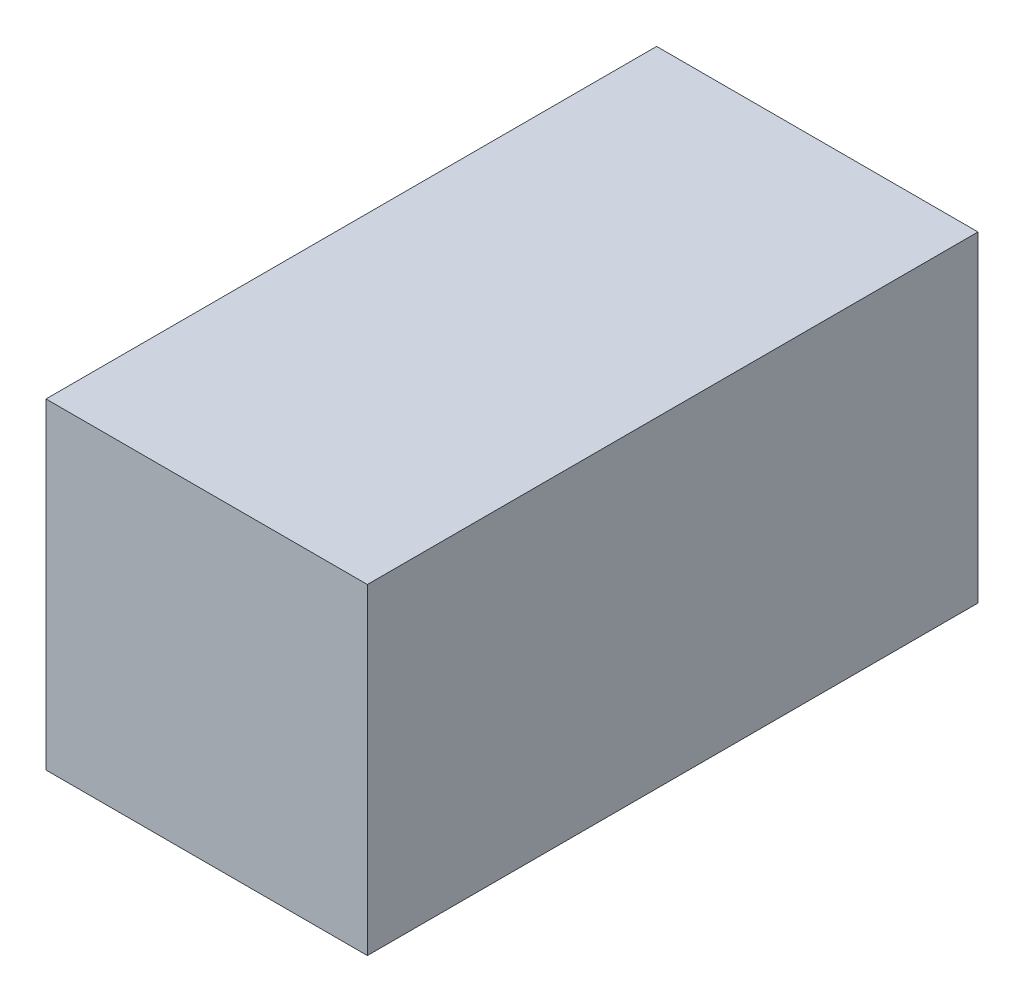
ISO-10303-21;
HEADER;
FILE_DESCRIPTION(('STEP AP214'),'2;1');
FILE_NAME('part.step','',(''),(''),'','','');
FILE_SCHEMA(('AUTOMOTIVE_DESIGN { 1 0 10303 214 1 1 1 1 }'));
ENDSEC;
DATA;
#1=APPLICATION_CONTEXT('core data for automotive mechanical design processes');
#2=APPLICATION_PROTOCOL_DEFINITION('international standard','automotive_design',2000,#1);
#3=PRODUCT_CONTEXT('',#1,'mechanical');
#4=PRODUCT('Part','Part','',(#3));
#5=PRODUCT_RELATED_PRODUCT_CATEGORY('part','',(#4));
#6=PRODUCT_DEFINITION_FORMATION('','',#4);
#7=PRODUCT_DEFINITION_CONTEXT('part definition',#1,'design');
#8=PRODUCT_DEFINITION('design','',#6,#7);
#9=PRODUCT_DEFINITION_SHAPE('','',#8);
#10=(LENGTH_UNIT() NAMED_UNIT(*) SI_UNIT(.MILLI.,.METRE.));
#11=(NAMED_UNIT(*) PLANE_ANGLE_UNIT() SI_UNIT($,.RADIAN.));
#12=(NAMED_UNIT(*) SI_UNIT($,.STERADIAN.) SOLID_ANGLE_UNIT());
#13=UNCERTAINTY_MEASURE_WITH_UNIT(LENGTH_MEASURE(1.E-05),#10,'distance_accuracy_value','');
#14=(GEOMETRIC_REPRESENTATION_CONTEXT(3) GLOBAL_UNCERTAINTY_ASSIGNED_CONTEXT((#13)) GLOBAL_UNIT_ASSIGNED_CONTEXT((#10,
#11,#12)) REPRESENTATION_CONTEXT('',''));
#15=CARTESIAN_POINT('',(0.,0.,0.));
#16=DIRECTION('',(0.,0.,1.));
#17=DIRECTION('',(1.,0.,0.));
#18=AXIS2_PLACEMENT_3D('',#15,#16,#17);
#19=CARTESIAN_POINT('',(50.,0.,95.));
#20=DIRECTION('',(0.,1.,0.));
#21=DIRECTION('',(-1.,0.,0.));
#22=AXIS2_PLACEMENT_3D('',#19,#20,#21);
#23=PLANE('',#22);
#24=DIRECTION('',(1.,0.,0.));
#25=VECTOR('',#24,1.);
#26=CARTESIAN_POINT('',(50.,0.,0.));
#27=LINE('',#26,#25);
#28=CARTESIAN_POINT('',(0.,0.,0.));
#29=VERTEX_POINT('',#28);
#30=CARTESIAN_POINT('',(50.,0.,0.));
#31=VERTEX_POINT('',#30);
#32=EDGE_CURVE('E106',#29,#31,#27,.T.);
#33=ORIENTED_EDGE('',*,*,#32,.T.);
#34=DIRECTION('',(0.,0.,-1.));
#35=VECTOR('',#34,1.);
#36=CARTESIAN_POINT('',(50.,0.,95.));
#37=LINE('',#36,#35);
#38=CARTESIAN_POINT('',(50.,0.,95.));
#39=VERTEX_POINT('',#38);
#40=EDGE_CURVE('E11',#39,#31,#37,.T.);
#41=ORIENTED_EDGE('',*,*,#40,.F.);
#42=DIRECTION('',(1.,0.,0.));
#43=VECTOR('',#42,1.);
#44=CARTESIAN_POINT('',(50.,0.,95.));
#45=LINE('',#44,#43);
#46=CARTESIAN_POINT('',(0.,0.,95.));
#47=VERTEX_POINT('',#46);
#48=EDGE_CURVE('E94',#47,#39,#45,.T.);
#49=ORIENTED_EDGE('',*,*,#48,.F.);
#50=DIRECTION('',(0.,0.,-1.));
#51=VECTOR('',#50,1.);
#52=CARTESIAN_POINT('',(0.,0.,95.));
#53=LINE('',#52,#51);
#54=EDGE_CURVE('E102',#47,#29,#53,.T.);
#55=ORIENTED_EDGE('',*,*,#54,.T.);
#56=EDGE_LOOP('',(#33,#41,#49,#55));
#57=FACE_BOUND('',#56,.T.);
#58=ADVANCED_FACE('F43',(#57),#23,.F.);
#59=CARTESIAN_POINT('',(50.,50.,95.));
#60=DIRECTION('',(-1.,0.,0.));
#61=DIRECTION('',(0.,-1.,0.));
#62=AXIS2_PLACEMENT_3D('',#59,#60,#61);
#63=PLANE('',#62);
#64=DIRECTION('',(0.,1.,0.));
#65=VECTOR('',#64,1.);
#66=CARTESIAN_POINT('',(50.,50.,0.));
#67=LINE('',#66,#65);
#68=CARTESIAN_POINT('',(50.,50.,0.));
#69=VERTEX_POINT('',#68);
#70=EDGE_CURVE('E98',#31,#69,#67,.T.);
#71=ORIENTED_EDGE('',*,*,#70,.T.);
#72=DIRECTION('',(0.,0.,-1.));
#73=VECTOR('',#72,1.);
#74=CARTESIAN_POINT('',(50.,50.,95.));
#75=LINE('',#74,#73);
#76=CARTESIAN_POINT('',(50.,50.,95.));
#77=VERTEX_POINT('',#76);
#78=EDGE_CURVE('E51',#77,#69,#75,.T.);
#79=ORIENTED_EDGE('',*,*,#78,.F.);
#80=DIRECTION('',(0.,1.,0.));
#81=VECTOR('',#80,1.);
#82=CARTESIAN_POINT('',(50.,50.,95.));
#83=LINE('',#82,#81);
#84=EDGE_CURVE('E89',#39,#77,#83,.T.);
#85=ORIENTED_EDGE('',*,*,#84,.F.);
#86=ORIENTED_EDGE('',*,*,#40,.T.);
#87=EDGE_LOOP('',(#71,#79,#85,#86));
#88=FACE_BOUND('',#87,.T.);
#89=ADVANCED_FACE('F97',(#88),#63,.F.);
#90=CARTESIAN_POINT('',(0.,50.,95.));
#91=DIRECTION('',(0.,-1.,0.));
#92=DIRECTION('',(1.,0.,0.));
#93=AXIS2_PLACEMENT_3D('',#90,#91,#92);
#94=PLANE('',#93);
#95=DIRECTION('',(-1.,0.,0.));
#96=VECTOR('',#95,1.);
#97=CARTESIAN_POINT('',(0.,50.,0.));
#98=LINE('',#97,#96);
#99=CARTESIAN_POINT('',(0.,50.,0.));
#100=VERTEX_POINT('',#99);
#101=EDGE_CURVE('E76',#69,#100,#98,.T.);
#102=ORIENTED_EDGE('',*,*,#101,.T.);
#103=DIRECTION('',(0.,0.,-1.));
#104=VECTOR('',#103,1.);
#105=CARTESIAN_POINT('',(0.,50.,95.));
#106=LINE('',#105,#104);
#107=CARTESIAN_POINT('',(0.,50.,95.));
#108=VERTEX_POINT('',#107);
#109=EDGE_CURVE('E99',#108,#100,#106,.T.);
#110=ORIENTED_EDGE('',*,*,#109,.F.);
#111=DIRECTION('',(-1.,0.,0.));
#112=VECTOR('',#111,1.);
#113=CARTESIAN_POINT('',(0.,50.,95.));
#114=LINE('',#113,#112);
#115=EDGE_CURVE('E92',#77,#108,#114,.T.);
#116=ORIENTED_EDGE('',*,*,#115,.F.);
#117=ORIENTED_EDGE('',*,*,#78,.T.);
#118=EDGE_LOOP('',(#102,#110,#116,#117));
#119=FACE_BOUND('',#118,.T.);
#120=ADVANCED_FACE('F100',(#119),#94,.F.);
#121=CARTESIAN_POINT('',(0.,0.,95.));
#122=DIRECTION('',(1.,0.,0.));
#123=DIRECTION('',(0.,0.,-1.));
#124=AXIS2_PLACEMENT_3D('',#121,#122,#123);
#125=PLANE('',#124);
#126=DIRECTION('',(0.,-1.,0.));
#127=VECTOR('',#126,1.);
#128=CARTESIAN_POINT('',(0.,0.,0.));
#129=LINE('',#128,#127);
#130=EDGE_CURVE('E82',#100,#29,#129,.T.);
#131=ORIENTED_EDGE('',*,*,#130,.T.);
#132=ORIENTED_EDGE('',*,*,#54,.F.);
#133=DIRECTION('',(0.,-1.,0.));
#134=VECTOR('',#133,1.);
#135=CARTESIAN_POINT('',(0.,0.,95.));
#136=LINE('',#135,#134);
#137=EDGE_CURVE('E59',#108,#47,#136,.T.);
#138=ORIENTED_EDGE('',*,*,#137,.F.);
#139=ORIENTED_EDGE('',*,*,#109,.T.);
#140=EDGE_LOOP('',(#131,#132,#138,#139));
#141=FACE_BOUND('',#140,.T.);
#142=ADVANCED_FACE('F113',(#141),#125,.F.);
#143=CARTESIAN_POINT('',(0.,0.,95.));
#144=DIRECTION('',(0.,0.,-1.));
#145=DIRECTION('',(-1.,0.,0.));
#146=AXIS2_PLACEMENT_3D('',#143,#144,#145);
#147=PLANE('',#146);
#148=ORIENTED_EDGE('',*,*,#48,.T.);
#149=ORIENTED_EDGE('',*,*,#84,.T.);
#150=ORIENTED_EDGE('',*,*,#115,.T.);
#151=ORIENTED_EDGE('',*,*,#137,.T.);
#152=EDGE_LOOP('',(#148,#149,#150,#151));
#153=FACE_BOUND('',#152,.T.);
#154=ADVANCED_FACE('F90',(#153),#147,.F.);
#155=CARTESIAN_POINT('',(0.,0.,0.));
#156=DIRECTION('',(0.,0.,-1.));
#157=DIRECTION('',(-1.,0.,0.));
#158=AXIS2_PLACEMENT_3D('',#155,#156,#157);
#159=PLANE('',#158);
#160=ORIENTED_EDGE('',*,*,#32,.F.);
#161=ORIENTED_EDGE('',*,*,#130,.F.);
#162=ORIENTED_EDGE('',*,*,#101,.F.);
#163=ORIENTED_EDGE('',*,*,#70,.F.);
#164=EDGE_LOOP('',(#160,#161,#162,#163));
#165=FACE_BOUND('',#164,.T.);
#166=ADVANCED_FACE('F116',(#165),#159,.T.);
#167=CLOSED_SHELL('',(#58,#89,#120,#142,#154,#166));
#168=MANIFOLD_SOLID_BREP('B2',#167);
#169=ADVANCED_BREP_SHAPE_REPRESENTATION('',(#18,#168),#14);
#170=SHAPE_DEFINITION_REPRESENTATION(#9,#169);
ENDSEC;
END-ISO-10303-21;
